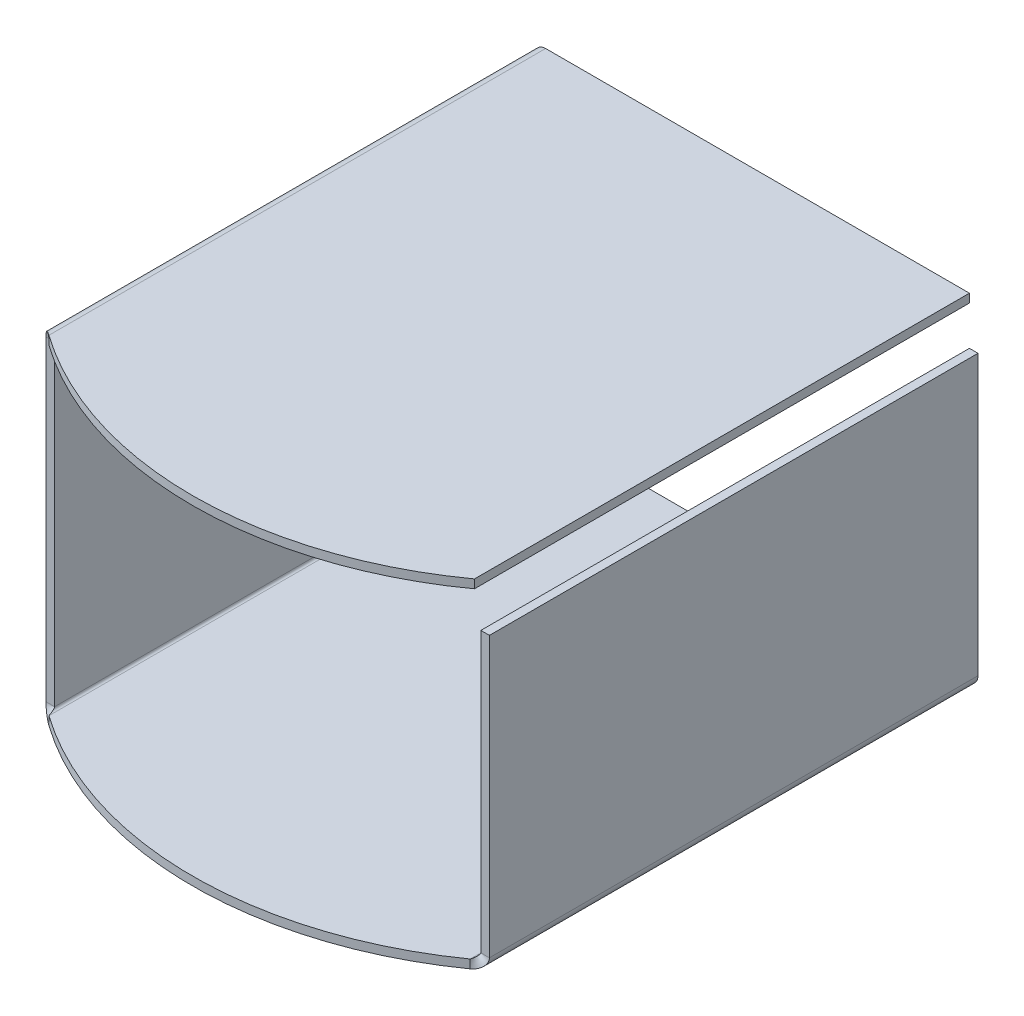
ISO-10303-21;
HEADER;
FILE_DESCRIPTION(('STEP AP214'),'2;1');
FILE_NAME('part.step','',(''),(''),'','','');
FILE_SCHEMA(('AUTOMOTIVE_DESIGN { 1 0 10303 214 1 1 1 1 }'));
ENDSEC;
DATA;
#1=APPLICATION_CONTEXT('core data for automotive mechanical design processes');
#2=APPLICATION_PROTOCOL_DEFINITION('international standard','automotive_design',2000,#1);
#3=PRODUCT_CONTEXT('',#1,'mechanical');
#4=PRODUCT('Part','Part','',(#3));
#5=PRODUCT_RELATED_PRODUCT_CATEGORY('part','',(#4));
#6=PRODUCT_DEFINITION_FORMATION('','',#4);
#7=PRODUCT_DEFINITION_CONTEXT('part definition',#1,'design');
#8=PRODUCT_DEFINITION('design','',#6,#7);
#9=PRODUCT_DEFINITION_SHAPE('','',#8);
#10=(LENGTH_UNIT() NAMED_UNIT(*) SI_UNIT(.MILLI.,.METRE.));
#11=(NAMED_UNIT(*) PLANE_ANGLE_UNIT() SI_UNIT($,.RADIAN.));
#12=(NAMED_UNIT(*) SI_UNIT($,.STERADIAN.) SOLID_ANGLE_UNIT());
#13=UNCERTAINTY_MEASURE_WITH_UNIT(LENGTH_MEASURE(1.E-05),#10,'distance_accuracy_value','');
#14=(GEOMETRIC_REPRESENTATION_CONTEXT(3) GLOBAL_UNCERTAINTY_ASSIGNED_CONTEXT((#13)) GLOBAL_UNIT_ASSIGNED_CONTEXT((#10,
#11,#12)) REPRESENTATION_CONTEXT('',''));
#15=CARTESIAN_POINT('',(0.,0.,0.));
#16=DIRECTION('',(0.,0.,1.));
#17=DIRECTION('',(1.,0.,0.));
#18=AXIS2_PLACEMENT_3D('',#15,#16,#17);
#19=CARTESIAN_POINT('',(60.7785714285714,-40.0957142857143,201.168));
#20=DIRECTION('',(-1.,0.,0.));
#21=DIRECTION('',(0.,0.,1.));
#22=AXIS2_PLACEMENT_3D('',#19,#20,#21);
#23=PLANE('',#22);
#24=DIRECTION('',(0.,-1.,0.));
#25=VECTOR('',#24,1.);
#26=CARTESIAN_POINT('',(60.7785714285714,386.974384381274,144.72450420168));
#27=LINE('',#26,#25);
#28=CARTESIAN_POINT('',(60.7785714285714,43.3614285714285,144.72450420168));
#29=VERTEX_POINT('',#28);
#30=CARTESIAN_POINT('',(60.7785714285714,-39.3591142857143,144.72450420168));
#31=VERTEX_POINT('',#30);
#32=EDGE_CURVE('E160',#29,#31,#27,.T.);
#33=ORIENTED_EDGE('',*,*,#32,.T.);
#34=DIRECTION('',(0.,0.,-1.));
#35=VECTOR('',#34,1.);
#36=CARTESIAN_POINT('',(60.7785714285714,-39.3591142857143,201.168));
#37=LINE('',#36,#35);
#38=CARTESIAN_POINT('',(60.7785714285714,-39.3591142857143,0.));
#39=VERTEX_POINT('',#38);
#40=EDGE_CURVE('E58',#31,#39,#37,.T.);
#41=ORIENTED_EDGE('',*,*,#40,.T.);
#42=DIRECTION('',(0.,1.,0.));
#43=VECTOR('',#42,1.);
#44=CARTESIAN_POINT('',(60.7785714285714,-40.0957142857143,0.));
#45=LINE('',#44,#43);
#46=CARTESIAN_POINT('',(60.7785714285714,43.3614285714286,0.));
#47=VERTEX_POINT('',#46);
#48=EDGE_CURVE('E168',#39,#47,#45,.T.);
#49=ORIENTED_EDGE('',*,*,#48,.T.);
#50=DIRECTION('',(0.,0.,-1.));
#51=VECTOR('',#50,1.);
#52=CARTESIAN_POINT('',(60.7785714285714,43.3614285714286,201.168));
#53=LINE('',#52,#51);
#54=EDGE_CURVE('E186',#29,#47,#53,.T.);
#55=ORIENTED_EDGE('',*,*,#54,.F.);
#56=EDGE_LOOP('',(#33,#41,#49,#55));
#57=FACE_BOUND('',#56,.T.);
#58=ADVANCED_FACE('F35',(#57),#23,.F.);
#59=CARTESIAN_POINT('',(58.2385714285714,43.3614285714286,201.168));
#60=DIRECTION('',(0.,1.,0.));
#61=DIRECTION('',(0.,0.,1.));
#62=AXIS2_PLACEMENT_3D('',#59,#60,#61);
#63=PLANE('',#62);
#64=DIRECTION('',(0.,0.,-1.));
#65=VECTOR('',#64,1.);
#66=CARTESIAN_POINT('',(58.2385714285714,43.3614285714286,201.168));
#67=LINE('',#66,#65);
#68=CARTESIAN_POINT('',(58.2385714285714,43.3614285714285,144.72450420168));
#69=VERTEX_POINT('',#68);
#70=CARTESIAN_POINT('',(58.2385714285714,43.3614285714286,0.));
#71=VERTEX_POINT('',#70);
#72=EDGE_CURVE('E184',#69,#71,#67,.T.);
#73=ORIENTED_EDGE('',*,*,#72,.F.);
#74=DIRECTION('',(1.,0.,0.));
#75=VECTOR('',#74,1.);
#76=CARTESIAN_POINT('',(60.7785714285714,43.3614285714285,144.72450420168));
#77=LINE('',#76,#75);
#78=EDGE_CURVE('E156',#29,#69,#77,.F.);
#79=ORIENTED_EDGE('',*,*,#78,.F.);
#80=ORIENTED_EDGE('',*,*,#54,.T.);
#81=DIRECTION('',(1.,0.,0.));
#82=VECTOR('',#81,1.);
#83=CARTESIAN_POINT('',(58.2385714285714,43.3614285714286,0.));
#84=LINE('',#83,#82);
#85=EDGE_CURVE('E300',#71,#47,#84,.T.);
#86=ORIENTED_EDGE('',*,*,#85,.F.);
#87=EDGE_LOOP('',(#73,#79,#80,#86));
#88=FACE_BOUND('',#87,.T.);
#89=ADVANCED_FACE('F424',(#88),#63,.T.);
#90=CARTESIAN_POINT('',(58.2385714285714,-40.0957142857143,201.168));
#91=DIRECTION('',(-1.,0.,0.));
#92=DIRECTION('',(0.,0.,1.));
#93=AXIS2_PLACEMENT_3D('',#90,#91,#92);
#94=PLANE('',#93);
#95=DIRECTION('',(0.,0.,-1.));
#96=VECTOR('',#95,1.);
#97=CARTESIAN_POINT('',(58.2385714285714,-39.3591142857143,201.168));
#98=LINE('',#97,#96);
#99=CARTESIAN_POINT('',(58.2385714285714,-39.3591142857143,144.72450420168));
#100=VERTEX_POINT('',#99);
#101=CARTESIAN_POINT('',(58.2385714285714,-39.3591142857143,0.));
#102=VERTEX_POINT('',#101);
#103=EDGE_CURVE('E174',#100,#102,#98,.T.);
#104=ORIENTED_EDGE('',*,*,#103,.F.);
#105=DIRECTION('',(0.,1.,0.));
#106=VECTOR('',#105,1.);
#107=CARTESIAN_POINT('',(58.2385714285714,-40.0957142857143,144.72450420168));
#108=LINE('',#107,#106);
#109=EDGE_CURVE('E150',#69,#100,#108,.F.);
#110=ORIENTED_EDGE('',*,*,#109,.F.);
#111=ORIENTED_EDGE('',*,*,#72,.T.);
#112=DIRECTION('',(0.,1.,0.));
#113=VECTOR('',#112,1.);
#114=CARTESIAN_POINT('',(58.2385714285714,-40.0957142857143,0.));
#115=LINE('',#114,#113);
#116=EDGE_CURVE('E182',#102,#71,#115,.T.);
#117=ORIENTED_EDGE('',*,*,#116,.F.);
#118=EDGE_LOOP('',(#104,#110,#111,#117));
#119=FACE_BOUND('',#118,.T.);
#120=ADVANCED_FACE('F180',(#119),#94,.T.);
#121=CARTESIAN_POINT('',(57.5019714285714,-39.3591142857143,201.168));
#122=DIRECTION('',(0.,0.,-1.));
#123=DIRECTION('',(-1.,0.,0.));
#124=AXIS2_PLACEMENT_3D('',#121,#122,#123);
#125=CYLINDRICAL_SURFACE('',#124,0.7366);
#126=DIRECTION('',(0.,0.,-1.));
#127=VECTOR('',#126,1.);
#128=CARTESIAN_POINT('',(57.5019714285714,-40.0957142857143,201.168));
#129=LINE('',#128,#127);
#130=CARTESIAN_POINT('',(57.5019714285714,-40.0957142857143,147.139308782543));
#131=VERTEX_POINT('',#130);
#132=CARTESIAN_POINT('',(57.5019714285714,-40.0957142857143,0.));
#133=VERTEX_POINT('',#132);
#134=EDGE_CURVE('E176',#131,#133,#129,.T.);
#135=ORIENTED_EDGE('',*,*,#134,.F.);
#136=CARTESIAN_POINT('',(58.2385714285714,-39.3591142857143,144.72450420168));
#137=CARTESIAN_POINT('',(58.2385831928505,-39.3723393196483,144.724460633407));
#138=CARTESIAN_POINT('',(58.2382158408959,-39.3855106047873,144.725702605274));
#139=CARTESIAN_POINT('',(58.23683312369,-39.4112369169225,144.730396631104));
#140=CARTESIAN_POINT('',(58.2358268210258,-39.4237979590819,144.733817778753));
#141=CARTESIAN_POINT('',(58.2329203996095,-39.4515257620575,144.743721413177));
#142=CARTESIAN_POINT('',(58.2308507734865,-39.4664615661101,144.750786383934));
#143=CARTESIAN_POINT('',(58.2260663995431,-39.4950443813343,144.767097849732));
#144=CARTESIAN_POINT('',(58.2233478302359,-39.5086830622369,144.776357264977));
#145=CARTESIAN_POINT('',(58.2152393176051,-39.54453779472,144.803983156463));
#146=CARTESIAN_POINT('',(58.2093873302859,-39.5654119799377,144.823929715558));
#147=CARTESIAN_POINT('',(58.196920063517,-39.6041390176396,144.866290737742));
#148=CARTESIAN_POINT('',(58.1903030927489,-39.6219849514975,144.88871066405));
#149=CARTESIAN_POINT('',(58.1731736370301,-39.6637572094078,144.946729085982));
#150=CARTESIAN_POINT('',(58.1623762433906,-39.6862251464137,144.983282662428));
#151=CARTESIAN_POINT('',(58.1401990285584,-39.7276125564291,145.05820667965));
#152=CARTESIAN_POINT('',(58.1288179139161,-39.746523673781,145.096581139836));
#153=CARTESIAN_POINT('',(58.105630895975,-39.7817501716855,145.174597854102));
#154=CARTESIAN_POINT('',(58.0938232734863,-39.7980531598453,145.214245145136));
#155=CARTESIAN_POINT('',(58.0699622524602,-39.8285163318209,145.294218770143));
#156=CARTESIAN_POINT('',(58.0579091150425,-39.8426786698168,145.334544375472));
#157=CARTESIAN_POINT('',(58.024692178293,-39.8790404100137,145.445475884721));
#158=CARTESIAN_POINT('',(58.0033328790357,-39.8995119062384,145.516588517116));
#159=CARTESIAN_POINT('',(57.9601818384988,-39.9365449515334,145.659720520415));
#160=CARTESIAN_POINT('',(57.9383898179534,-39.9531038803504,145.731740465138));
#161=CARTESIAN_POINT('',(57.8945564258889,-39.9829389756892,145.876114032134));
#162=CARTESIAN_POINT('',(57.8725160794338,-39.9962255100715,145.948465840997));
#163=CARTESIAN_POINT('',(57.8281596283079,-40.0200329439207,146.093540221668));
#164=CARTESIAN_POINT('',(57.8058435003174,-40.0305536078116,146.166262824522));
#165=CARTESIAN_POINT('',(57.7603831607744,-40.0493487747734,146.313860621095));
#166=CARTESIAN_POINT('',(57.7372325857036,-40.0575570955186,146.388742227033));
#167=CARTESIAN_POINT('',(57.6907065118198,-40.0715383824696,146.538669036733));
#168=CARTESIAN_POINT('',(57.6673309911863,-40.0773111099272,146.613714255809));
#169=CARTESIAN_POINT('',(57.6203967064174,-40.0865261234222,146.763857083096));
#170=CARTESIAN_POINT('',(57.5968380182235,-40.0899693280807,146.838954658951));
#171=CARTESIAN_POINT('',(57.5495397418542,-40.094557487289,146.989147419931));
#172=CARTESIAN_POINT('',(57.525800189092,-40.0957028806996,147.064242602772));
#173=CARTESIAN_POINT('',(57.5019714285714,-40.0957142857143,147.139308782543));
#174=B_SPLINE_CURVE_WITH_KNOTS('',3,(#136,#137,#138,#139,#140,#141,#142,#143,#144,#145,#146,
#147,#148,#149,#150,#151,#152,#153,#154,#155,#156,#157,#158,#159,#160,#161,#162,#163,#164,#165,
#166,#167,#168,#169,#170,#171,#172,#173),.UNSPECIFIED.,.F.,.F.,(4,2,2,2,2,2,2,2,2,2,2,2,2,2,2,2,
2,2,4),(0.,0.0395242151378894,0.0784999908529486,0.128172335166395,0.178144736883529,
0.266026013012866,0.354105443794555,0.486501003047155,0.619203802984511,0.752519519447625,
0.88570017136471,1.11660478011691,1.34766359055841,1.57798064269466,1.80831730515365,
2.0446979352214,2.28110173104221,2.51741224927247,2.75367763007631),.UNSPECIFIED.);
#175=EDGE_CURVE('E165',#100,#131,#174,.T.);
#176=ORIENTED_EDGE('',*,*,#175,.F.);
#177=ORIENTED_EDGE('',*,*,#103,.T.);
#178=CARTESIAN_POINT('',(57.5019714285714,-39.3591142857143,0.));
#179=DIRECTION('',(0.,0.,-1.));
#180=DIRECTION('',(-1.,0.,0.));
#181=AXIS2_PLACEMENT_3D('',#178,#179,#180);
#182=CIRCLE('',#181,0.7366);
#183=EDGE_CURVE('E294',#133,#102,#182,.F.);
#184=ORIENTED_EDGE('',*,*,#183,.F.);
#185=EDGE_LOOP('',(#135,#176,#177,#184));
#186=FACE_BOUND('',#185,.T.);
#187=ADVANCED_FACE('F172',(#186),#125,.F.);
#188=CARTESIAN_POINT('',(-68.0357142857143,-40.0957142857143,201.168));
#189=DIRECTION('',(0.,1.,0.));
#190=DIRECTION('',(0.,0.,1.));
#191=AXIS2_PLACEMENT_3D('',#188,#189,#190);
#192=PLANE('',#191);
#193=DIRECTION('',(0.,0.,-1.));
#194=VECTOR('',#193,1.);
#195=CARTESIAN_POINT('',(-67.2991142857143,-40.0957142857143,201.168));
#196=LINE('',#195,#194);
#197=CARTESIAN_POINT('',(-67.2991142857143,-40.0957142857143,147.139308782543));
#198=VERTEX_POINT('',#197);
#199=CARTESIAN_POINT('',(-67.2991142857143,-40.0957142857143,0.));
#200=VERTEX_POINT('',#199);
#201=EDGE_CURVE('E188',#198,#200,#196,.T.);
#202=ORIENTED_EDGE('',*,*,#201,.F.);
#203=CARTESIAN_POINT('',(-4.89857142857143,-40.0957142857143,59.0388824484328));
#204=DIRECTION('',(0.,1.,0.));
#205=DIRECTION('',(0.,0.,1.));
#206=AXIS2_PLACEMENT_3D('',#203,#204,#205);
#207=CIRCLE('',#206,107.960700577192);
#208=EDGE_CURVE('E309',#131,#198,#207,.F.);
#209=ORIENTED_EDGE('',*,*,#208,.F.);
#210=ORIENTED_EDGE('',*,*,#134,.T.);
#211=DIRECTION('',(1.,0.,0.));
#212=VECTOR('',#211,1.);
#213=CARTESIAN_POINT('',(-68.0357142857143,-40.0957142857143,0.));
#214=LINE('',#213,#212);
#215=EDGE_CURVE('E289',#200,#133,#214,.T.);
#216=ORIENTED_EDGE('',*,*,#215,.F.);
#217=EDGE_LOOP('',(#202,#209,#210,#216));
#218=FACE_BOUND('',#217,.T.);
#219=ADVANCED_FACE('F292',(#218),#192,.T.);
#220=CARTESIAN_POINT('',(-67.2991142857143,-39.3591142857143,201.168));
#221=DIRECTION('',(0.,0.,-1.));
#222=DIRECTION('',(-1.,0.,0.));
#223=AXIS2_PLACEMENT_3D('',#220,#221,#222);
#224=CYLINDRICAL_SURFACE('',#223,0.7366);
#225=DIRECTION('',(0.,0.,-1.));
#226=VECTOR('',#225,1.);
#227=CARTESIAN_POINT('',(-68.0357142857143,-39.3591142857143,201.168));
#228=LINE('',#227,#226);
#229=CARTESIAN_POINT('',(-68.0357142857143,-39.3591142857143,144.72450420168));
#230=VERTEX_POINT('',#229);
#231=CARTESIAN_POINT('',(-68.0357142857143,-39.3591142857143,0.));
#232=VERTEX_POINT('',#231);
#233=EDGE_CURVE('E223',#230,#232,#228,.T.);
#234=ORIENTED_EDGE('',*,*,#233,.F.);
#235=CARTESIAN_POINT('',(-67.2991142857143,-40.0957142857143,147.139308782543));
#236=CARTESIAN_POINT('',(-67.3233538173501,-40.0957019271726,147.062950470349));
#237=CARTESIAN_POINT('',(-67.347500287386,-40.094517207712,146.986561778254));
#238=CARTESIAN_POINT('',(-67.3956363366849,-40.0897672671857,146.833685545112));
#239=CARTESIAN_POINT('',(-67.4196256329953,-40.0861985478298,146.757198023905));
#240=CARTESIAN_POINT('',(-67.4674199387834,-40.0766417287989,146.604264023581));
#241=CARTESIAN_POINT('',(-67.4912248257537,-40.0706521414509,146.527817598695));
#242=CARTESIAN_POINT('',(-67.5390022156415,-40.0560137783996,146.373799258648));
#243=CARTESIAN_POINT('',(-67.5629707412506,-40.0473217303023,146.296230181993));
#244=CARTESIAN_POINT('',(-67.6106232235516,-40.0271048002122,146.141410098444));
#245=CARTESIAN_POINT('',(-67.6343073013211,-40.0155811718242,146.064158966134));
#246=CARTESIAN_POINT('',(-67.6813492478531,-39.9893545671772,145.910127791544));
#247=CARTESIAN_POINT('',(-67.7047072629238,-39.974653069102,145.833347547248));
#248=CARTESIAN_POINT('',(-67.7418790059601,-39.9480406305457,145.710726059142));
#249=CARTESIAN_POINT('',(-67.7558130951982,-39.937326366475,145.664660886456));
#250=CARTESIAN_POINT('',(-67.7835191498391,-39.9143227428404,145.572865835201));
#251=CARTESIAN_POINT('',(-67.7972910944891,-39.9020331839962,145.527135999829));
#252=CARTESIAN_POINT('',(-67.8245812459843,-39.8756630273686,145.436330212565));
#253=CARTESIAN_POINT('',(-67.8381002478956,-39.8615897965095,145.391252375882));
#254=CARTESIAN_POINT('',(-67.8648689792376,-39.8312496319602,145.301767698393));
#255=CARTESIAN_POINT('',(-67.8781188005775,-39.8149834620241,145.257360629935));
#256=CARTESIAN_POINT('',(-67.90117173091,-39.7838347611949,145.179937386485));
#257=CARTESIAN_POINT('',(-67.9110488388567,-39.7695349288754,145.146711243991));
#258=CARTESIAN_POINT('',(-67.9305469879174,-39.738855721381,145.081038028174));
#259=CARTESIAN_POINT('',(-67.940167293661,-39.7224710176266,145.048593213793));
#260=CARTESIAN_POINT('',(-67.9599923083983,-39.6851771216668,144.981640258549));
#261=CARTESIAN_POINT('',(-67.9701515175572,-39.6639729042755,144.947275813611));
#262=CARTESIAN_POINT('',(-67.9846885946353,-39.6287907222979,144.89799703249));
#263=CARTESIAN_POINT('',(-67.9894110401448,-39.6165207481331,144.881970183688));
#264=CARTESIAN_POINT('',(-67.99853222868,-39.590595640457,144.850990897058));
#265=CARTESIAN_POINT('',(-68.0029313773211,-39.5769422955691,144.836037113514));
#266=CARTESIAN_POINT('',(-68.0104681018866,-39.5506979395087,144.810402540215));
#267=CARTESIAN_POINT('',(-68.0136864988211,-39.5383986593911,144.79944994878));
#268=CARTESIAN_POINT('',(-68.0196884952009,-39.5125054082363,144.779020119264));
#269=CARTESIAN_POINT('',(-68.0224721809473,-39.4989116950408,144.769542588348));
#270=CARTESIAN_POINT('',(-68.0270401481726,-39.4724937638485,144.753992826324));
#271=CARTESIAN_POINT('',(-68.0289118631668,-39.459863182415,144.747622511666));
#272=CARTESIAN_POINT('',(-68.0320458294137,-39.4336986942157,144.736961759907));
#273=CARTESIAN_POINT('',(-68.0333102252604,-39.4201681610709,144.732664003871));
#274=CARTESIAN_POINT('',(-68.034695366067,-39.3986131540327,144.727959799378));
#275=CARTESIAN_POINT('',(-68.0350745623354,-39.3907924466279,144.726673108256));
#276=CARTESIAN_POINT('',(-68.0355852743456,-39.3750219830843,144.724940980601));
#277=CARTESIAN_POINT('',(-68.0357158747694,-39.3670718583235,144.724498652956));
#278=CARTESIAN_POINT('',(-68.0357142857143,-39.3591142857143,144.72450420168));
#279=B_SPLINE_CURVE_WITH_KNOTS('',3,(#235,#236,#237,#238,#239,#240,#241,#242,#243,#244,#245,
#246,#247,#248,#249,#250,#251,#252,#253,#254,#255,#256,#257,#258,#259,#260,#261,#262,#263,#264,
#265,#266,#267,#268,#269,#270,#271,#272,#273,#274,#275,#276,#277,#278),.UNSPECIFIED.,.F.,.F.,(4,
2,2,2,2,2,2,2,2,2,2,2,2,2,2,2,2,2,2,2,2,4),(0.,0.240332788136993,0.481019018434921,
0.721853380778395,0.966762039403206,1.211562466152,1.45624926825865,1.60414223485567,
1.75205392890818,1.89937349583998,2.04664188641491,2.15907836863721,2.27180821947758,
2.39643714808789,2.45857312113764,2.52062975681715,2.57088527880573,2.62113081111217,
2.66379107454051,2.70629956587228,2.73005846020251,2.75390466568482),.UNSPECIFIED.);
#280=EDGE_CURVE('E280',#198,#230,#279,.T.);
#281=ORIENTED_EDGE('',*,*,#280,.F.);
#282=ORIENTED_EDGE('',*,*,#201,.T.);
#283=CARTESIAN_POINT('',(-67.2991142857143,-39.3591142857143,0.));
#284=DIRECTION('',(0.,0.,-1.));
#285=DIRECTION('',(-1.,0.,0.));
#286=AXIS2_PLACEMENT_3D('',#283,#284,#285);
#287=CIRCLE('',#286,0.7366);
#288=EDGE_CURVE('E226',#232,#200,#287,.F.);
#289=ORIENTED_EDGE('',*,*,#288,.F.);
#290=EDGE_LOOP('',(#234,#281,#282,#289));
#291=FACE_BOUND('',#290,.T.);
#292=ADVANCED_FACE('F278',(#291),#224,.F.);
#293=CARTESIAN_POINT('',(-68.0357142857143,54.9728571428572,201.168));
#294=DIRECTION('',(1.,0.,0.));
#295=DIRECTION('',(0.,0.,-1.));
#296=AXIS2_PLACEMENT_3D('',#293,#294,#295);
#297=PLANE('',#296);
#298=DIRECTION('',(0.,0.,-1.));
#299=VECTOR('',#298,1.);
#300=CARTESIAN_POINT('',(-68.0357142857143,54.2362571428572,201.168));
#301=LINE('',#300,#299);
#302=CARTESIAN_POINT('',(-68.0357142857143,54.2362571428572,144.72450420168));
#303=VERTEX_POINT('',#302);
#304=CARTESIAN_POINT('',(-68.0357142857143,54.2362571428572,0.));
#305=VERTEX_POINT('',#304);
#306=EDGE_CURVE('E221',#303,#305,#301,.T.);
#307=ORIENTED_EDGE('',*,*,#306,.F.);
#308=DIRECTION('',(0.,1.,0.));
#309=VECTOR('',#308,1.);
#310=CARTESIAN_POINT('',(-68.0357142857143,54.9728571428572,144.72450420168));
#311=LINE('',#310,#309);
#312=EDGE_CURVE('E318',#303,#230,#311,.F.);
#313=ORIENTED_EDGE('',*,*,#312,.T.);
#314=ORIENTED_EDGE('',*,*,#233,.T.);
#315=DIRECTION('',(0.,-1.,0.));
#316=VECTOR('',#315,1.);
#317=CARTESIAN_POINT('',(-68.0357142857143,54.9728571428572,0.));
#318=LINE('',#317,#316);
#319=EDGE_CURVE('E210',#305,#232,#318,.T.);
#320=ORIENTED_EDGE('',*,*,#319,.F.);
#321=EDGE_LOOP('',(#307,#313,#314,#320));
#322=FACE_BOUND('',#321,.T.);
#323=ADVANCED_FACE('F219',(#322),#297,.T.);
#324=CARTESIAN_POINT('',(-67.2991142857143,54.2362571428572,201.168));
#325=DIRECTION('',(0.,0.,-1.));
#326=DIRECTION('',(-1.,0.,0.));
#327=AXIS2_PLACEMENT_3D('',#324,#325,#326);
#328=CYLINDRICAL_SURFACE('',#327,0.7366);
#329=DIRECTION('',(0.,0.,-1.));
#330=VECTOR('',#329,1.);
#331=CARTESIAN_POINT('',(-67.2991142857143,54.9728571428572,201.168));
#332=LINE('',#331,#330);
#333=CARTESIAN_POINT('',(-67.2991142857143,54.9728571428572,147.139308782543));
#334=VERTEX_POINT('',#333);
#335=CARTESIAN_POINT('',(-67.2991142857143,54.9728571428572,0.));
#336=VERTEX_POINT('',#335);
#337=EDGE_CURVE('E271',#334,#336,#332,.T.);
#338=ORIENTED_EDGE('',*,*,#337,.F.);
#339=CARTESIAN_POINT('',(-68.0357142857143,54.2362571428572,144.72450420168));
#340=CARTESIAN_POINT('',(-68.0357260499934,54.2494821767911,144.724460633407));
#341=CARTESIAN_POINT('',(-68.0353586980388,54.2626534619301,144.725702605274));
#342=CARTESIAN_POINT('',(-68.0339759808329,54.2883797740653,144.730396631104));
#343=CARTESIAN_POINT('',(-68.0329696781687,54.3009408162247,144.733817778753));
#344=CARTESIAN_POINT('',(-68.0300632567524,54.3286686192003,144.743721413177));
#345=CARTESIAN_POINT('',(-68.0279936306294,54.3436044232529,144.750786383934));
#346=CARTESIAN_POINT('',(-68.023209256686,54.372187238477,144.767097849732));
#347=CARTESIAN_POINT('',(-68.0204906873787,54.3858259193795,144.776357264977));
#348=CARTESIAN_POINT('',(-68.012382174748,54.4216806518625,144.803983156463));
#349=CARTESIAN_POINT('',(-68.0065301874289,54.4425548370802,144.823929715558));
#350=CARTESIAN_POINT('',(-67.9940629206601,54.481281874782,144.866290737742));
#351=CARTESIAN_POINT('',(-67.987445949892,54.4991278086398,144.888710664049));
#352=CARTESIAN_POINT('',(-67.9703164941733,54.5409000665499,144.946729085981));
#353=CARTESIAN_POINT('',(-67.9595191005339,54.5633680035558,144.983282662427));
#354=CARTESIAN_POINT('',(-67.9373418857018,54.6047554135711,145.058206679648));
#355=CARTESIAN_POINT('',(-67.9259607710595,54.623666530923,145.096581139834));
#356=CARTESIAN_POINT('',(-67.9027737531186,54.6588930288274,145.1745978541));
#357=CARTESIAN_POINT('',(-67.8909661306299,54.6751960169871,145.214245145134));
#358=CARTESIAN_POINT('',(-67.867105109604,54.7056591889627,145.294218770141));
#359=CARTESIAN_POINT('',(-67.8550519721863,54.7198215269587,145.334544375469));
#360=CARTESIAN_POINT('',(-67.8218350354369,54.7561832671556,145.445475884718));
#361=CARTESIAN_POINT('',(-67.8004757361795,54.7766547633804,145.516588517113));
#362=CARTESIAN_POINT('',(-67.7573246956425,54.8136878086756,145.659720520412));
#363=CARTESIAN_POINT('',(-67.735532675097,54.8302467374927,145.731740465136));
#364=CARTESIAN_POINT('',(-67.6916992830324,54.8600818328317,145.876114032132));
#365=CARTESIAN_POINT('',(-67.6696589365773,54.873368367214,145.948465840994));
#366=CARTESIAN_POINT('',(-67.6253024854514,54.8971758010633,146.093540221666));
#367=CARTESIAN_POINT('',(-67.6029863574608,54.9076964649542,146.16626282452));
#368=CARTESIAN_POINT('',(-67.5575260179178,54.9264916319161,146.313860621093));
#369=CARTESIAN_POINT('',(-67.5343754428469,54.9346999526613,146.388742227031));
#370=CARTESIAN_POINT('',(-67.4878493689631,54.9486812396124,146.538669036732));
#371=CARTESIAN_POINT('',(-67.4644738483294,54.95445396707,146.613714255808));
#372=CARTESIAN_POINT('',(-67.4175395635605,54.9636689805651,146.763857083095));
#373=CARTESIAN_POINT('',(-67.3939808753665,54.9671121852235,146.838954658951));
#374=CARTESIAN_POINT('',(-67.3466825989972,54.9717003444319,146.989147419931));
#375=CARTESIAN_POINT('',(-67.3229430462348,54.9728457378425,147.064242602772));
#376=CARTESIAN_POINT('',(-67.2991142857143,54.9728571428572,147.139308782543));
#377=B_SPLINE_CURVE_WITH_KNOTS('',3,(#339,#340,#341,#342,#343,#344,#345,#346,#347,#348,#349,
#350,#351,#352,#353,#354,#355,#356,#357,#358,#359,#360,#361,#362,#363,#364,#365,#366,#367,#368,
#369,#370,#371,#372,#373,#374,#375,#376),.UNSPECIFIED.,.F.,.F.,(4,2,2,2,2,2,2,2,2,2,2,2,2,2,2,2,
2,2,4),(0.,0.0395242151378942,0.0784999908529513,0.128172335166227,0.17814473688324,
0.266026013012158,0.354105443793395,0.486501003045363,0.619203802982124,0.75251951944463,
0.88570017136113,1.11660478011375,1.3476635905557,1.57798064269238,1.8083173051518,
2.04469793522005,2.28110173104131,2.51741224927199,2.75367763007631),.UNSPECIFIED.);
#378=EDGE_CURVE('E335',#303,#334,#377,.T.);
#379=ORIENTED_EDGE('',*,*,#378,.F.);
#380=ORIENTED_EDGE('',*,*,#306,.T.);
#381=CARTESIAN_POINT('',(-67.2991142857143,54.2362571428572,0.));
#382=DIRECTION('',(0.,0.,-1.));
#383=DIRECTION('',(-1.,0.,0.));
#384=AXIS2_PLACEMENT_3D('',#381,#382,#383);
#385=CIRCLE('',#384,0.7366);
#386=EDGE_CURVE('E225',#336,#305,#385,.F.);
#387=ORIENTED_EDGE('',*,*,#386,.F.);
#388=EDGE_LOOP('',(#338,#379,#380,#387));
#389=FACE_BOUND('',#388,.T.);
#390=ADVANCED_FACE('F412',(#389),#328,.F.);
#391=CARTESIAN_POINT('',(58.2385714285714,54.9728571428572,201.168));
#392=DIRECTION('',(0.,-1.,0.));
#393=DIRECTION('',(0.,0.,-1.));
#394=AXIS2_PLACEMENT_3D('',#391,#392,#393);
#395=PLANE('',#394);
#396=DIRECTION('',(0.,0.,-1.));
#397=VECTOR('',#396,1.);
#398=CARTESIAN_POINT('',(58.2385714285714,54.9728571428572,201.168));
#399=LINE('',#398,#397);
#400=CARTESIAN_POINT('',(58.2385714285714,54.9728571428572,146.612931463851));
#401=VERTEX_POINT('',#400);
#402=CARTESIAN_POINT('',(58.2385714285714,54.9728571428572,0.));
#403=VERTEX_POINT('',#402);
#404=EDGE_CURVE('E269',#401,#403,#399,.T.);
#405=ORIENTED_EDGE('',*,*,#404,.F.);
#406=CARTESIAN_POINT('',(-4.89857142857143,54.9728571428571,59.0388824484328));
#407=DIRECTION('',(0.,-1.,0.));
#408=DIRECTION('',(0.,0.,-1.));
#409=AXIS2_PLACEMENT_3D('',#406,#407,#408);
#410=CIRCLE('',#409,107.960700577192);
#411=EDGE_CURVE('E329',#334,#401,#410,.F.);
#412=ORIENTED_EDGE('',*,*,#411,.F.);
#413=ORIENTED_EDGE('',*,*,#337,.T.);
#414=DIRECTION('',(-1.,0.,0.));
#415=VECTOR('',#414,1.);
#416=CARTESIAN_POINT('',(58.2385714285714,54.9728571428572,0.));
#417=LINE('',#416,#415);
#418=EDGE_CURVE('E233',#403,#336,#417,.T.);
#419=ORIENTED_EDGE('',*,*,#418,.F.);
#420=EDGE_LOOP('',(#405,#412,#413,#419));
#421=FACE_BOUND('',#420,.T.);
#422=ADVANCED_FACE('F410',(#421),#395,.T.);
#423=CARTESIAN_POINT('',(58.2385714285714,57.5128571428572,201.168));
#424=DIRECTION('',(1.,0.,0.));
#425=DIRECTION('',(0.,0.,-1.));
#426=AXIS2_PLACEMENT_3D('',#423,#424,#425);
#427=PLANE('',#426);
#428=DIRECTION('',(0.,0.,-1.));
#429=VECTOR('',#428,1.);
#430=CARTESIAN_POINT('',(58.2385714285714,57.5128571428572,201.168));
#431=LINE('',#430,#429);
#432=CARTESIAN_POINT('',(58.2385714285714,57.5128571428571,146.612931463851));
#433=VERTEX_POINT('',#432);
#434=CARTESIAN_POINT('',(58.2385714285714,57.5128571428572,0.));
#435=VERTEX_POINT('',#434);
#436=EDGE_CURVE('E267',#433,#435,#431,.T.);
#437=ORIENTED_EDGE('',*,*,#436,.F.);
#438=DIRECTION('',(0.,1.,0.));
#439=VECTOR('',#438,1.);
#440=CARTESIAN_POINT('',(58.2385714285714,57.5128571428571,146.612931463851));
#441=LINE('',#440,#439);
#442=EDGE_CURVE('E324',#433,#401,#441,.F.);
#443=ORIENTED_EDGE('',*,*,#442,.T.);
#444=ORIENTED_EDGE('',*,*,#404,.T.);
#445=DIRECTION('',(0.,-1.,0.));
#446=VECTOR('',#445,1.);
#447=CARTESIAN_POINT('',(58.2385714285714,57.5128571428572,0.));
#448=LINE('',#447,#446);
#449=EDGE_CURVE('E235',#435,#403,#448,.T.);
#450=ORIENTED_EDGE('',*,*,#449,.F.);
#451=EDGE_LOOP('',(#437,#443,#444,#450));
#452=FACE_BOUND('',#451,.T.);
#453=ADVANCED_FACE('F406',(#452),#427,.T.);
#454=CARTESIAN_POINT('',(58.2385714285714,57.5128571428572,201.168));
#455=DIRECTION('',(0.,-1.,0.));
#456=DIRECTION('',(0.,0.,-1.));
#457=AXIS2_PLACEMENT_3D('',#454,#455,#456);
#458=PLANE('',#457);
#459=CARTESIAN_POINT('',(-4.89857142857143,57.5128571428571,59.0388824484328));
#460=DIRECTION('',(0.,-1.,0.));
#461=DIRECTION('',(0.,0.,-1.));
#462=AXIS2_PLACEMENT_3D('',#459,#460,#461);
#463=CIRCLE('',#462,107.960700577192);
#464=CARTESIAN_POINT('',(-67.2991142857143,57.5128571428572,147.139308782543));
#465=VERTEX_POINT('',#464);
#466=EDGE_CURVE('E332',#465,#433,#463,.F.);
#467=ORIENTED_EDGE('',*,*,#466,.T.);
#468=ORIENTED_EDGE('',*,*,#436,.T.);
#469=DIRECTION('',(1.,0.,0.));
#470=VECTOR('',#469,1.);
#471=CARTESIAN_POINT('',(58.2385714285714,57.5128571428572,0.));
#472=LINE('',#471,#470);
#473=CARTESIAN_POINT('',(-67.2991142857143,57.5128571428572,0.));
#474=VERTEX_POINT('',#473);
#475=EDGE_CURVE('E241',#435,#474,#472,.F.);
#476=ORIENTED_EDGE('',*,*,#475,.T.);
#477=DIRECTION('',(0.,0.,-1.));
#478=VECTOR('',#477,1.);
#479=CARTESIAN_POINT('',(-67.2991142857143,57.5128571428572,201.168));
#480=LINE('',#479,#478);
#481=EDGE_CURVE('E265',#465,#474,#480,.T.);
#482=ORIENTED_EDGE('',*,*,#481,.F.);
#483=EDGE_LOOP('',(#467,#468,#476,#482));
#484=FACE_BOUND('',#483,.T.);
#485=ADVANCED_FACE('F402',(#484),#458,.F.);
#486=CARTESIAN_POINT('',(-67.2991142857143,54.2362571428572,201.168));
#487=DIRECTION('',(0.,0.,-1.));
#488=DIRECTION('',(-1.,0.,0.));
#489=AXIS2_PLACEMENT_3D('',#486,#487,#488);
#490=CYLINDRICAL_SURFACE('',#489,3.2766);
#491=CARTESIAN_POINT('',(-70.5757142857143,54.2362571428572,144.72450420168));
#492=CARTESIAN_POINT('',(-70.5757150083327,54.2796039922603,144.724503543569));
#493=CARTESIAN_POINT('',(-70.5748539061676,54.3229441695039,144.725156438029));
#494=CARTESIAN_POINT('',(-70.5714170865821,54.4095137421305,144.727773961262));
#495=CARTESIAN_POINT('',(-70.5688414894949,54.4527431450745,144.729738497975));
#496=CARTESIAN_POINT('',(-70.5585630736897,54.5820432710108,144.737601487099));
#497=CARTESIAN_POINT('',(-70.5483085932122,54.6678116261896,144.745469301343));
#498=CARTESIAN_POINT('',(-70.5213059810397,54.836978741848,144.766161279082));
#499=CARTESIAN_POINT('',(-70.50461070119,54.920391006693,144.778945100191));
#500=CARTESIAN_POINT('',(-70.4650560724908,55.084835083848,144.809242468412));
#501=CARTESIAN_POINT('',(-70.4421965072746,55.1658668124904,144.826756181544));
#502=CARTESIAN_POINT('',(-70.3715414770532,55.384066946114,144.880722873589));
#503=CARTESIAN_POINT('',(-70.3178239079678,55.5183135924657,144.921590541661));
#504=CARTESIAN_POINT('',(-70.2259406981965,55.7110120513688,144.991486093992));
#505=CARTESIAN_POINT('',(-70.1933920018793,55.7738554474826,145.016244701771));
#506=CARTESIAN_POINT('',(-70.1248078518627,55.8965266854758,145.068308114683));
#507=CARTESIAN_POINT('',(-70.0887720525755,55.9563542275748,145.095613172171));
#508=CARTESIAN_POINT('',(-69.9654113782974,56.1472501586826,145.18894607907));
#509=CARTESIAN_POINT('',(-69.8713731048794,56.271694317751,145.259881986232));
#510=CARTESIAN_POINT('',(-69.6702196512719,56.5028637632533,145.411083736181));
#511=CARTESIAN_POINT('',(-69.5631001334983,56.6095831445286,145.491352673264));
#512=CARTESIAN_POINT('',(-69.3166605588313,56.8241548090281,145.675201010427));
#513=CARTESIAN_POINT('',(-69.1751295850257,56.9281913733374,145.780277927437));
#514=CARTESIAN_POINT('',(-68.8811980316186,57.110828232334,145.997321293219));
#515=CARTESIAN_POINT('',(-68.7287810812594,57.1893891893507,146.109298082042));
#516=CARTESIAN_POINT('',(-68.3688064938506,57.3411978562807,146.372172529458));
#517=CARTESIAN_POINT('',(-68.1585430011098,57.4056109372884,146.524576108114));
#518=CARTESIAN_POINT('',(-67.8386392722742,57.4699634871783,146.75472437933));
#519=CARTESIAN_POINT('',(-67.7313388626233,57.4860364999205,146.8316369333));
#520=CARTESIAN_POINT('',(-67.5158016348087,57.5074703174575,146.985526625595));
#521=CARTESIAN_POINT('',(-67.4075653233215,57.5128365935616,147.062503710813));
#522=CARTESIAN_POINT('',(-67.2991142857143,57.5128571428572,147.139308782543));
#523=B_SPLINE_CURVE_WITH_KNOTS('',3,(#491,#492,#493,#494,#495,#496,#497,#498,#499,#500,#501,
#502,#503,#504,#505,#506,#507,#508,#509,#510,#511,#512,#513,#514,#515,#516,#517,#518,#519,#520,
#521,#522),.UNSPECIFIED.,.F.,.F.,(4,2,2,2,2,2,2,2,2,2,2,2,2,2,2,4),(0.,0.130013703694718,
0.260018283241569,0.519771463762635,0.777437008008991,1.03511159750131,1.48382797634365,
1.70861568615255,1.93342569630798,2.44541806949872,2.9575806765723,3.56934429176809,
4.18204810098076,4.98054134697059,5.37916562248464,5.77758614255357),.UNSPECIFIED.);
#524=CARTESIAN_POINT('',(-70.5757142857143,54.2362571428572,144.72450420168));
#525=VERTEX_POINT('',#524);
#526=EDGE_CURVE('E337',#525,#465,#523,.T.);
#527=ORIENTED_EDGE('',*,*,#526,.T.);
#528=ORIENTED_EDGE('',*,*,#481,.T.);
#529=CARTESIAN_POINT('',(-67.2991142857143,54.2362571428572,0.));
#530=DIRECTION('',(0.,0.,1.));
#531=DIRECTION('',(1.,0.,0.));
#532=AXIS2_PLACEMENT_3D('',#529,#530,#531);
#533=CIRCLE('',#532,3.2766);
#534=CARTESIAN_POINT('',(-70.5757142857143,54.2362571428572,0.));
#535=VERTEX_POINT('',#534);
#536=EDGE_CURVE('E244',#474,#535,#533,.T.);
#537=ORIENTED_EDGE('',*,*,#536,.T.);
#538=DIRECTION('',(0.,0.,-1.));
#539=VECTOR('',#538,1.);
#540=CARTESIAN_POINT('',(-70.5757142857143,54.2362571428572,201.168));
#541=LINE('',#540,#539);
#542=EDGE_CURVE('E263',#525,#535,#541,.T.);
#543=ORIENTED_EDGE('',*,*,#542,.F.);
#544=EDGE_LOOP('',(#527,#528,#537,#543));
#545=FACE_BOUND('',#544,.T.);
#546=ADVANCED_FACE('F394',(#545),#490,.T.);
#547=CARTESIAN_POINT('',(-70.5757142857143,54.9728571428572,201.168));
#548=DIRECTION('',(1.,0.,0.));
#549=DIRECTION('',(0.,0.,-1.));
#550=AXIS2_PLACEMENT_3D('',#547,#548,#549);
#551=PLANE('',#550);
#552=DIRECTION('',(0.,-1.,0.));
#553=VECTOR('',#552,1.);
#554=CARTESIAN_POINT('',(-70.5757142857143,386.974384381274,144.72450420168));
#555=LINE('',#554,#553);
#556=CARTESIAN_POINT('',(-70.5757142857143,-39.3591142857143,144.72450420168));
#557=VERTEX_POINT('',#556);
#558=EDGE_CURVE('E321',#525,#557,#555,.T.);
#559=ORIENTED_EDGE('',*,*,#558,.F.);
#560=ORIENTED_EDGE('',*,*,#542,.T.);
#561=DIRECTION('',(0.,1.,0.));
#562=VECTOR('',#561,1.);
#563=CARTESIAN_POINT('',(-70.5757142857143,54.9728571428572,0.));
#564=LINE('',#563,#562);
#565=CARTESIAN_POINT('',(-70.5757142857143,-39.3591142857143,0.));
#566=VERTEX_POINT('',#565);
#567=EDGE_CURVE('E212',#535,#566,#564,.F.);
#568=ORIENTED_EDGE('',*,*,#567,.T.);
#569=DIRECTION('',(0.,0.,-1.));
#570=VECTOR('',#569,1.);
#571=CARTESIAN_POINT('',(-70.5757142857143,-39.3591142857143,201.168));
#572=LINE('',#571,#570);
#573=EDGE_CURVE('E261',#557,#566,#572,.T.);
#574=ORIENTED_EDGE('',*,*,#573,.F.);
#575=EDGE_LOOP('',(#559,#560,#568,#574));
#576=FACE_BOUND('',#575,.T.);
#577=ADVANCED_FACE('F392',(#576),#551,.F.);
#578=CARTESIAN_POINT('',(-67.2991142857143,-39.3591142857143,201.168));
#579=DIRECTION('',(0.,0.,-1.));
#580=DIRECTION('',(-1.,0.,0.));
#581=AXIS2_PLACEMENT_3D('',#578,#579,#580);
#582=CYLINDRICAL_SURFACE('',#581,3.2766);
#583=CARTESIAN_POINT('',(-67.2991142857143,-42.6357142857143,147.139308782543));
#584=CARTESIAN_POINT('',(-67.4341001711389,-42.6356952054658,147.043719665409));
#585=CARTESIAN_POINT('',(-67.5688266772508,-42.627373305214,146.947799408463));
#586=CARTESIAN_POINT('',(-67.8128339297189,-42.597100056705,146.7732427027));
#587=CARTESIAN_POINT('',(-67.9224068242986,-42.5778150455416,146.694545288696));
#588=CARTESIAN_POINT('',(-68.1395796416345,-42.5280455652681,146.538002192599));
#589=CARTESIAN_POINT('',(-68.2471799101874,-42.497563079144,146.460156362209));
#590=CARTESIAN_POINT('',(-68.4596590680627,-42.4253566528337,146.305825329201));
#591=CARTESIAN_POINT('',(-68.5645364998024,-42.3836268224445,146.229340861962));
#592=CARTESIAN_POINT('',(-68.7707640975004,-42.2888327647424,146.078380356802));
#593=CARTESIAN_POINT('',(-68.8721095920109,-42.2357541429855,146.003907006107));
#594=CARTESIAN_POINT('',(-69.1300183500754,-42.0827188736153,145.813715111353));
#595=CARTESIAN_POINT('',(-69.2830224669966,-41.9737960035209,145.70020875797));
#596=CARTESIAN_POINT('',(-69.5722937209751,-41.7265642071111,145.484565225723));
#597=CARTESIAN_POINT('',(-69.7085902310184,-41.5883080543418,145.382408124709));
#598=CARTESIAN_POINT('',(-69.8843313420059,-41.3738640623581,145.250082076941));
#599=CARTESIAN_POINT('',(-69.9333079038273,-41.3094443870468,145.213126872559));
#600=CARTESIAN_POINT('',(-70.0270334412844,-41.1760347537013,145.142283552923));
#601=CARTESIAN_POINT('',(-70.0717847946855,-41.1070474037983,145.108393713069));
#602=CARTESIAN_POINT('',(-70.156611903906,-40.9646326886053,145.044098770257));
#603=CARTESIAN_POINT('',(-70.1966844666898,-40.8912023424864,145.013696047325));
#604=CARTESIAN_POINT('',(-70.2715865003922,-40.7402774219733,144.956775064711));
#605=CARTESIAN_POINT('',(-70.3064167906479,-40.6627834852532,144.930256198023));
#606=CARTESIAN_POINT('',(-70.3706328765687,-40.5033758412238,144.881299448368));
#607=CARTESIAN_POINT('',(-70.3999630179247,-40.4214267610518,144.858903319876));
#608=CARTESIAN_POINT('',(-70.4522373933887,-40.2544193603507,144.818953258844));
#609=CARTESIAN_POINT('',(-70.4751856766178,-40.1693630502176,144.80139625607));
#610=CARTESIAN_POINT('',(-70.5142342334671,-39.9970034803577,144.771515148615));
#611=CARTESIAN_POINT('',(-70.5303501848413,-39.9097058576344,144.759179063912));
#612=CARTESIAN_POINT('',(-70.555463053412,-39.7335499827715,144.739967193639));
#613=CARTESIAN_POINT('',(-70.5644661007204,-39.6446931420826,144.733086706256));
#614=CARTESIAN_POINT('',(-70.5717859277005,-39.5228333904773,144.727498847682));
#615=CARTESIAN_POINT('',(-70.5732594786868,-39.4900958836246,144.726374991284));
#616=CARTESIAN_POINT('',(-70.5752229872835,-39.4246121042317,144.72487815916));
#617=CARTESIAN_POINT('',(-70.5757140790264,-39.3918658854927,144.724504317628));
#618=CARTESIAN_POINT('',(-70.5757142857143,-39.3591142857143,144.72450420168));
#619=B_SPLINE_CURVE_WITH_KNOTS('',3,(#583,#584,#585,#586,#587,#588,#589,#590,#591,#592,#593,
#594,#595,#596,#597,#598,#599,#600,#601,#602,#603,#604,#605,#606,#607,#608,#609,#610,#611,#612,
#613,#614,#615,#616,#617,#618),.UNSPECIFIED.,.F.,.F.,(4,2,2,2,2,2,2,2,2,2,2,2,2,2,2,2,2,4),(0.,
0.495950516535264,0.904321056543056,1.31261931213,1.72113180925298,2.13016555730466,
2.78587917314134,3.44042294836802,3.70709838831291,3.97362284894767,4.24032814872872,
4.5069917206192,4.77622299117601,5.04528304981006,5.3137223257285,5.58192999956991,
5.68028183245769,5.77852006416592),.UNSPECIFIED.);
#620=CARTESIAN_POINT('',(-67.2991142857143,-42.6357142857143,147.139308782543));
#621=VERTEX_POINT('',#620);
#622=EDGE_CURVE('E177',#621,#557,#619,.T.);
#623=ORIENTED_EDGE('',*,*,#622,.T.);
#624=ORIENTED_EDGE('',*,*,#573,.T.);
#625=CARTESIAN_POINT('',(-67.2991142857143,-39.3591142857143,0.));
#626=DIRECTION('',(0.,0.,1.));
#627=DIRECTION('',(1.,0.,0.));
#628=AXIS2_PLACEMENT_3D('',#625,#626,#627);
#629=CIRCLE('',#628,3.2766);
#630=CARTESIAN_POINT('',(-67.2991142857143,-42.6357142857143,0.));
#631=VERTEX_POINT('',#630);
#632=EDGE_CURVE('E247',#566,#631,#629,.T.);
#633=ORIENTED_EDGE('',*,*,#632,.T.);
#634=DIRECTION('',(0.,0.,-1.));
#635=VECTOR('',#634,1.);
#636=CARTESIAN_POINT('',(-67.2991142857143,-42.6357142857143,201.168));
#637=LINE('',#636,#635);
#638=EDGE_CURVE('E259',#621,#631,#637,.T.);
#639=ORIENTED_EDGE('',*,*,#638,.F.);
#640=EDGE_LOOP('',(#623,#624,#633,#639));
#641=FACE_BOUND('',#640,.T.);
#642=ADVANCED_FACE('F457',(#641),#582,.T.);
#643=CARTESIAN_POINT('',(-68.0357142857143,-42.6357142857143,201.168));
#644=DIRECTION('',(0.,1.,0.));
#645=DIRECTION('',(0.,0.,1.));
#646=AXIS2_PLACEMENT_3D('',#643,#644,#645);
#647=PLANE('',#646);
#648=CARTESIAN_POINT('',(-4.89857142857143,-42.6357142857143,59.0388824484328));
#649=DIRECTION('',(0.,1.,0.));
#650=DIRECTION('',(0.,0.,1.));
#651=AXIS2_PLACEMENT_3D('',#648,#649,#650);
#652=CIRCLE('',#651,107.960700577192);
#653=CARTESIAN_POINT('',(57.5019714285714,-42.6357142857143,147.139308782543));
#654=VERTEX_POINT('',#653);
#655=EDGE_CURVE('E50',#654,#621,#652,.F.);
#656=ORIENTED_EDGE('',*,*,#655,.T.);
#657=ORIENTED_EDGE('',*,*,#638,.T.);
#658=DIRECTION('',(1.,0.,0.));
#659=VECTOR('',#658,1.);
#660=CARTESIAN_POINT('',(-68.0357142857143,-42.6357142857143,0.));
#661=LINE('',#660,#659);
#662=CARTESIAN_POINT('',(57.5019714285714,-42.6357142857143,0.));
#663=VERTEX_POINT('',#662);
#664=EDGE_CURVE('E250',#631,#663,#661,.T.);
#665=ORIENTED_EDGE('',*,*,#664,.T.);
#666=DIRECTION('',(0.,0.,-1.));
#667=VECTOR('',#666,1.);
#668=CARTESIAN_POINT('',(57.5019714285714,-42.6357142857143,201.168));
#669=LINE('',#668,#667);
#670=EDGE_CURVE('E257',#654,#663,#669,.T.);
#671=ORIENTED_EDGE('',*,*,#670,.F.);
#672=EDGE_LOOP('',(#656,#657,#665,#671));
#673=FACE_BOUND('',#672,.T.);
#674=ADVANCED_FACE('F451',(#673),#647,.F.);
#675=CARTESIAN_POINT('',(57.5019714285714,-39.3591142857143,201.168));
#676=DIRECTION('',(0.,0.,-1.));
#677=DIRECTION('',(-1.,0.,0.));
#678=AXIS2_PLACEMENT_3D('',#675,#676,#677);
#679=CYLINDRICAL_SURFACE('',#678,3.2766);
#680=CARTESIAN_POINT('',(60.7785714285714,-39.3591142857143,144.72450420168));
#681=CARTESIAN_POINT('',(60.7785721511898,-39.4024611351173,144.724503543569));
#682=CARTESIAN_POINT('',(60.7777110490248,-39.4458013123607,144.725156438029));
#683=CARTESIAN_POINT('',(60.7742742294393,-39.5323708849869,144.727773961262));
#684=CARTESIAN_POINT('',(60.771698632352,-39.5756002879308,144.729738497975));
#685=CARTESIAN_POINT('',(60.761420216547,-39.7049004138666,144.737601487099));
#686=CARTESIAN_POINT('',(60.7511657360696,-39.790668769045,144.745469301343));
#687=CARTESIAN_POINT('',(60.7241631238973,-39.9598358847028,144.766161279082));
#688=CARTESIAN_POINT('',(60.7074678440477,-40.0432481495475,144.77894510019));
#689=CARTESIAN_POINT('',(60.6679132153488,-40.2076922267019,144.809242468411));
#690=CARTESIAN_POINT('',(60.6450536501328,-40.288723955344,144.826756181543));
#691=CARTESIAN_POINT('',(60.5743986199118,-40.5069240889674,144.880722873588));
#692=CARTESIAN_POINT('',(60.5206810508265,-40.6411707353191,144.921590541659));
#693=CARTESIAN_POINT('',(60.4287978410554,-40.8338691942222,144.99148609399));
#694=CARTESIAN_POINT('',(60.3962491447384,-40.8967125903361,145.01624470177));
#695=CARTESIAN_POINT('',(60.3276649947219,-41.0193838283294,145.068308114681));
#696=CARTESIAN_POINT('',(60.2916291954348,-41.0792113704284,145.095613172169));
#697=CARTESIAN_POINT('',(60.168268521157,-41.2701073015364,145.188946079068));
#698=CARTESIAN_POINT('',(60.0742302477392,-41.3945514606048,145.25988198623));
#699=CARTESIAN_POINT('',(59.8730767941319,-41.6257209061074,145.411083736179));
#700=CARTESIAN_POINT('',(59.7659572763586,-41.7324402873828,145.491352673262));
#701=CARTESIAN_POINT('',(59.519517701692,-41.9470119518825,145.675201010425));
#702=CARTESIAN_POINT('',(59.3779867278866,-42.0510485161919,145.780277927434));
#703=CARTESIAN_POINT('',(59.0840551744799,-42.2336853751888,145.997321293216));
#704=CARTESIAN_POINT('',(58.931638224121,-42.3122463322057,146.109298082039));
#705=CARTESIAN_POINT('',(58.5716636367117,-42.4640549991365,146.372172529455));
#706=CARTESIAN_POINT('',(58.3614001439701,-42.5284680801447,146.524576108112));
#707=CARTESIAN_POINT('',(58.0414964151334,-42.5928206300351,146.754724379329));
#708=CARTESIAN_POINT('',(57.9341960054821,-42.6088936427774,146.831636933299));
#709=CARTESIAN_POINT('',(57.7186587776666,-42.6303274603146,146.985526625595));
#710=CARTESIAN_POINT('',(57.610422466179,-42.6356937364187,147.062503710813));
#711=CARTESIAN_POINT('',(57.5019714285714,-42.6357142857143,147.139308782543));
#712=B_SPLINE_CURVE_WITH_KNOTS('',3,(#680,#681,#682,#683,#684,#685,#686,#687,#688,#689,#690,
#691,#692,#693,#694,#695,#696,#697,#698,#699,#700,#701,#702,#703,#704,#705,#706,#707,#708,#709,
#710,#711),.UNSPECIFIED.,.F.,.F.,(4,2,2,2,2,2,2,2,2,2,2,2,2,2,2,4),(0.,0.130013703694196,
0.260018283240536,0.519771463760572,0.77743700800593,1.03511159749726,1.48382797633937,
1.70861568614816,1.93342569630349,2.44541806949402,2.95758067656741,3.56934429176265,
4.18204810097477,4.98054134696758,5.37916562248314,5.77758614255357),.UNSPECIFIED.);
#713=EDGE_CURVE('E167',#31,#654,#712,.T.);
#714=ORIENTED_EDGE('',*,*,#713,.T.);
#715=ORIENTED_EDGE('',*,*,#670,.T.);
#716=CARTESIAN_POINT('',(57.5019714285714,-39.3591142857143,0.));
#717=DIRECTION('',(0.,0.,1.));
#718=DIRECTION('',(1.,0.,0.));
#719=AXIS2_PLACEMENT_3D('',#716,#717,#718);
#720=CIRCLE('',#719,3.2766);
#721=EDGE_CURVE('E253',#663,#39,#720,.T.);
#722=ORIENTED_EDGE('',*,*,#721,.T.);
#723=ORIENTED_EDGE('',*,*,#40,.F.);
#724=EDGE_LOOP('',(#714,#715,#722,#723));
#725=FACE_BOUND('',#724,.T.);
#726=ADVANCED_FACE('F447',(#725),#679,.T.);
#727=CARTESIAN_POINT('',(-67.2991142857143,54.9728571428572,0.));
#728=DIRECTION('',(0.,0.,-1.));
#729=DIRECTION('',(-1.,0.,0.));
#730=AXIS2_PLACEMENT_3D('',#727,#728,#729);
#731=PLANE('',#730);
#732=DIRECTION('',(0.,1.,0.));
#733=VECTOR('',#732,1.);
#734=CARTESIAN_POINT('',(-67.2991142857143,54.9728571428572,0.));
#735=LINE('',#734,#733);
#736=EDGE_CURVE('E11',#336,#474,#735,.T.);
#737=ORIENTED_EDGE('',*,*,#736,.F.);
#738=ORIENTED_EDGE('',*,*,#386,.T.);
#739=DIRECTION('',(1.,0.,0.));
#740=VECTOR('',#739,1.);
#741=CARTESIAN_POINT('',(-70.5757142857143,54.2362571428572,0.));
#742=LINE('',#741,#740);
#743=EDGE_CURVE('E43',#535,#305,#742,.T.);
#744=ORIENTED_EDGE('',*,*,#743,.F.);
#745=ORIENTED_EDGE('',*,*,#536,.F.);
#746=EDGE_LOOP('',(#737,#738,#744,#745));
#747=FACE_BOUND('',#746,.T.);
#748=ADVANCED_FACE('F37',(#747),#731,.T.);
#749=CARTESIAN_POINT('',(-70.5757142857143,54.2362571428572,0.));
#750=DIRECTION('',(0.,0.,-1.));
#751=DIRECTION('',(-1.,0.,0.));
#752=AXIS2_PLACEMENT_3D('',#749,#750,#751);
#753=PLANE('',#752);
#754=ORIENTED_EDGE('',*,*,#418,.T.);
#755=ORIENTED_EDGE('',*,*,#736,.T.);
#756=ORIENTED_EDGE('',*,*,#475,.F.);
#757=ORIENTED_EDGE('',*,*,#449,.T.);
#758=EDGE_LOOP('',(#754,#755,#756,#757));
#759=FACE_BOUND('',#758,.T.);
#760=ADVANCED_FACE('F399',(#759),#753,.T.);
#761=CARTESIAN_POINT('',(-68.0357142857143,-39.3591142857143,0.));
#762=DIRECTION('',(0.,0.,-1.));
#763=DIRECTION('',(-1.,0.,0.));
#764=AXIS2_PLACEMENT_3D('',#761,#762,#763);
#765=PLANE('',#764);
#766=DIRECTION('',(-1.,0.,0.));
#767=VECTOR('',#766,1.);
#768=CARTESIAN_POINT('',(-68.0357142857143,-39.3591142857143,0.));
#769=LINE('',#768,#767);
#770=EDGE_CURVE('E201',#232,#566,#769,.T.);
#771=ORIENTED_EDGE('',*,*,#770,.F.);
#772=ORIENTED_EDGE('',*,*,#288,.T.);
#773=DIRECTION('',(0.,1.,0.));
#774=VECTOR('',#773,1.);
#775=CARTESIAN_POINT('',(-67.2991142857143,-42.6357142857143,0.));
#776=LINE('',#775,#774);
#777=EDGE_CURVE('E198',#631,#200,#776,.T.);
#778=ORIENTED_EDGE('',*,*,#777,.F.);
#779=ORIENTED_EDGE('',*,*,#632,.F.);
#780=EDGE_LOOP('',(#771,#772,#778,#779));
#781=FACE_BOUND('',#780,.T.);
#782=ADVANCED_FACE('F296',(#781),#765,.T.);
#783=CARTESIAN_POINT('',(-67.2991142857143,-42.6357142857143,0.));
#784=DIRECTION('',(0.,0.,-1.));
#785=DIRECTION('',(-1.,0.,0.));
#786=AXIS2_PLACEMENT_3D('',#783,#784,#785);
#787=PLANE('',#786);
#788=ORIENTED_EDGE('',*,*,#319,.T.);
#789=ORIENTED_EDGE('',*,*,#770,.T.);
#790=ORIENTED_EDGE('',*,*,#567,.F.);
#791=ORIENTED_EDGE('',*,*,#743,.T.);
#792=EDGE_LOOP('',(#788,#789,#790,#791));
#793=FACE_BOUND('',#792,.T.);
#794=ADVANCED_FACE('F209',(#793),#787,.T.);
#795=CARTESIAN_POINT('',(57.5019714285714,-40.0957142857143,0.));
#796=DIRECTION('',(0.,0.,-1.));
#797=DIRECTION('',(-1.,0.,0.));
#798=AXIS2_PLACEMENT_3D('',#795,#796,#797);
#799=PLANE('',#798);
#800=DIRECTION('',(0.,-1.,0.));
#801=VECTOR('',#800,1.);
#802=CARTESIAN_POINT('',(57.5019714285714,-40.0957142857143,0.));
#803=LINE('',#802,#801);
#804=EDGE_CURVE('E195',#133,#663,#803,.T.);
#805=ORIENTED_EDGE('',*,*,#804,.F.);
#806=ORIENTED_EDGE('',*,*,#183,.T.);
#807=DIRECTION('',(-1.,0.,0.));
#808=VECTOR('',#807,1.);
#809=CARTESIAN_POINT('',(60.7785714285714,-39.3591142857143,0.));
#810=LINE('',#809,#808);
#811=EDGE_CURVE('E193',#39,#102,#810,.T.);
#812=ORIENTED_EDGE('',*,*,#811,.F.);
#813=ORIENTED_EDGE('',*,*,#721,.F.);
#814=EDGE_LOOP('',(#805,#806,#812,#813));
#815=FACE_BOUND('',#814,.T.);
#816=ADVANCED_FACE('F436',(#815),#799,.T.);
#817=CARTESIAN_POINT('',(60.7785714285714,-39.3591142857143,0.));
#818=DIRECTION('',(0.,0.,-1.));
#819=DIRECTION('',(-1.,0.,0.));
#820=AXIS2_PLACEMENT_3D('',#817,#818,#819);
#821=PLANE('',#820);
#822=ORIENTED_EDGE('',*,*,#215,.T.);
#823=ORIENTED_EDGE('',*,*,#804,.T.);
#824=ORIENTED_EDGE('',*,*,#664,.F.);
#825=ORIENTED_EDGE('',*,*,#777,.T.);
#826=EDGE_LOOP('',(#822,#823,#824,#825));
#827=FACE_BOUND('',#826,.T.);
#828=ADVANCED_FACE('F288',(#827),#821,.T.);
#829=CARTESIAN_POINT('',(57.5019714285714,-39.3591142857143,0.));
#830=DIRECTION('',(0.,0.,-1.));
#831=DIRECTION('',(-1.,0.,0.));
#832=AXIS2_PLACEMENT_3D('',#829,#830,#831);
#833=PLANE('',#832);
#834=ORIENTED_EDGE('',*,*,#48,.F.);
#835=ORIENTED_EDGE('',*,*,#811,.T.);
#836=ORIENTED_EDGE('',*,*,#116,.T.);
#837=ORIENTED_EDGE('',*,*,#85,.T.);
#838=EDGE_LOOP('',(#834,#835,#836,#837));
#839=FACE_BOUND('',#838,.T.);
#840=ADVANCED_FACE('F435',(#839),#833,.T.);
#841=CARTESIAN_POINT('',(60.7785714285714,386.974384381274,144.72450420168));
#842=DIRECTION('',(0.,0.,-1.));
#843=DIRECTION('',(0.,-1.,0.));
#844=AXIS2_PLACEMENT_3D('',#841,#842,#843);
#845=PLANE('',#844);
#846=DIRECTION('',(1.,0.,0.));
#847=VECTOR('',#846,1.);
#848=CARTESIAN_POINT('',(60.7785714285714,-39.3591142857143,144.72450420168));
#849=LINE('',#848,#847);
#850=EDGE_CURVE('E153',#31,#100,#849,.F.);
#851=ORIENTED_EDGE('',*,*,#850,.F.);
#852=ORIENTED_EDGE('',*,*,#32,.F.);
#853=ORIENTED_EDGE('',*,*,#78,.T.);
#854=ORIENTED_EDGE('',*,*,#109,.T.);
#855=EDGE_LOOP('',(#851,#852,#853,#854));
#856=FACE_BOUND('',#855,.T.);
#857=ADVANCED_FACE('F152',(#856),#845,.F.);
#858=CARTESIAN_POINT('',(-4.89857142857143,-42.6357142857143,59.0388824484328));
#859=DIRECTION('',(0.,1.,0.));
#860=DIRECTION('',(0.,0.,1.));
#861=AXIS2_PLACEMENT_3D('',#858,#859,#860);
#862=CYLINDRICAL_SURFACE('',#861,107.960700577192);
#863=DIRECTION('',(0.,-1.,0.));
#864=VECTOR('',#863,1.);
#865=CARTESIAN_POINT('',(-67.2991142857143,-42.6357142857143,147.139308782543));
#866=LINE('',#865,#864);
#867=EDGE_CURVE('E305',#621,#198,#866,.F.);
#868=ORIENTED_EDGE('',*,*,#867,.F.);
#869=ORIENTED_EDGE('',*,*,#655,.F.);
#870=DIRECTION('',(0.,-1.,0.));
#871=VECTOR('',#870,1.);
#872=CARTESIAN_POINT('',(57.5019714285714,-42.6357142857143,147.139308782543));
#873=LINE('',#872,#871);
#874=EDGE_CURVE('E307',#654,#131,#873,.F.);
#875=ORIENTED_EDGE('',*,*,#874,.T.);
#876=ORIENTED_EDGE('',*,*,#208,.T.);
#877=EDGE_LOOP('',(#868,#869,#875,#876));
#878=FACE_BOUND('',#877,.T.);
#879=ADVANCED_FACE('F421',(#878),#862,.T.);
#880=CARTESIAN_POINT('',(-70.5757142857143,386.974384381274,144.72450420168));
#881=DIRECTION('',(0.,0.,1.));
#882=DIRECTION('',(0.,-1.,0.));
#883=AXIS2_PLACEMENT_3D('',#880,#881,#882);
#884=PLANE('',#883);
#885=DIRECTION('',(-1.,0.,0.));
#886=VECTOR('',#885,1.);
#887=CARTESIAN_POINT('',(-70.5757142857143,54.2362571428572,144.72450420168));
#888=LINE('',#887,#886);
#889=EDGE_CURVE('E313',#525,#303,#888,.F.);
#890=ORIENTED_EDGE('',*,*,#889,.F.);
#891=ORIENTED_EDGE('',*,*,#558,.T.);
#892=DIRECTION('',(-1.,0.,0.));
#893=VECTOR('',#892,1.);
#894=CARTESIAN_POINT('',(-70.5757142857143,-39.3591142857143,144.72450420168));
#895=LINE('',#894,#893);
#896=EDGE_CURVE('E315',#557,#230,#895,.F.);
#897=ORIENTED_EDGE('',*,*,#896,.T.);
#898=ORIENTED_EDGE('',*,*,#312,.F.);
#899=EDGE_LOOP('',(#890,#891,#897,#898));
#900=FACE_BOUND('',#899,.T.);
#901=ADVANCED_FACE('F387',(#900),#884,.T.);
#902=CARTESIAN_POINT('',(-4.89857142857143,57.5128571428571,59.0388824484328));
#903=DIRECTION('',(0.,-1.,0.));
#904=DIRECTION('',(0.,0.,-1.));
#905=AXIS2_PLACEMENT_3D('',#902,#903,#904);
#906=CYLINDRICAL_SURFACE('',#905,107.960700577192);
#907=ORIENTED_EDGE('',*,*,#442,.F.);
#908=ORIENTED_EDGE('',*,*,#466,.F.);
#909=DIRECTION('',(0.,1.,0.));
#910=VECTOR('',#909,1.);
#911=CARTESIAN_POINT('',(-67.2991142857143,57.5128571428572,147.139308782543));
#912=LINE('',#911,#910);
#913=EDGE_CURVE('E326',#465,#334,#912,.F.);
#914=ORIENTED_EDGE('',*,*,#913,.T.);
#915=ORIENTED_EDGE('',*,*,#411,.T.);
#916=EDGE_LOOP('',(#907,#908,#914,#915));
#917=FACE_BOUND('',#916,.T.);
#918=ADVANCED_FACE('F415',(#917),#906,.T.);
#919=CARTESIAN_POINT('',(-68.0103142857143,54.2362571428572,144.72450420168));
#920=CARTESIAN_POINT('',(-68.0103142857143,54.2890854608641,144.72450420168));
#921=CARTESIAN_POINT('',(-68.0045019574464,54.3405979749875,144.745047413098));
#922=CARTESIAN_POINT('',(-67.9821045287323,54.4411549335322,144.823990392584));
#923=CARTESIAN_POINT('',(-67.9653654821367,54.4899887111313,144.882921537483));
#924=CARTESIAN_POINT('',(-67.9236497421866,54.5800969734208,145.029158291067));
#925=CARTESIAN_POINT('',(-67.8981906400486,54.6225009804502,145.118145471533));
#926=CARTESIAN_POINT('',(-67.8413001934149,54.6989786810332,145.315926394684));
#927=CARTESIAN_POINT('',(-67.8098488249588,54.7333247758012,145.424799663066));
#928=CARTESIAN_POINT('',(-67.7414836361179,54.7950373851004,145.660000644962));
#929=CARTESIAN_POINT('',(-67.7054231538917,54.8216307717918,145.783390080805));
#930=CARTESIAN_POINT('',(-67.6300145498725,54.8673309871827,146.039731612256));
#931=CARTESIAN_POINT('',(-67.5903433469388,54.8865318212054,146.173766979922));
#932=CARTESIAN_POINT('',(-67.4690746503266,54.9322336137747,146.580650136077));
#933=CARTESIAN_POINT('',(-67.3852962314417,54.9474571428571,146.858080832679));
#934=CARTESIAN_POINT('',(-67.2991142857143,54.9474571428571,147.139308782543));
#935=CARTESIAN_POINT('',(-68.0357142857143,54.2362571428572,144.72450420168));
#936=CARTESIAN_POINT('',(-68.0357142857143,54.2909721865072,144.72450420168));
#937=CARTESIAN_POINT('',(-68.0296943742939,54.3443244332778,144.745047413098));
#938=CARTESIAN_POINT('',(-68.0064970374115,54.4484727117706,144.823990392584));
#939=CARTESIAN_POINT('',(-67.9891601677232,54.4990505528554,144.882921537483));
#940=CARTESIAN_POINT('',(-67.9459545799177,54.5923769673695,145.029158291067));
#941=CARTESIAN_POINT('',(-67.919586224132,54.6362954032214,145.118145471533));
#942=CARTESIAN_POINT('',(-67.8606639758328,54.7155044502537,145.315926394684));
#943=CARTESIAN_POINT('',(-67.8280893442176,54.7510771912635,145.424799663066));
#944=CARTESIAN_POINT('',(-67.7572825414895,54.8149938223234,145.660000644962));
#945=CARTESIAN_POINT('',(-67.7199341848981,54.8425369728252,145.783390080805));
#946=CARTESIAN_POINT('',(-67.6418324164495,54.8898693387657,146.039731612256));
#947=CARTESIAN_POINT('',(-67.6007443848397,54.9097559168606,146.173766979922));
#948=CARTESIAN_POINT('',(-67.4751446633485,54.9570899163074,146.580650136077));
#949=CARTESIAN_POINT('',(-67.3883741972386,54.9728571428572,146.858080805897));
#950=CARTESIAN_POINT('',(-67.2991142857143,54.9728571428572,147.139308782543));
#951=CARTESIAN_POINT('',(-70.5757142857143,54.2362571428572,144.72450420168));
#952=CARTESIAN_POINT('',(-70.5757142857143,54.4796447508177,144.72450420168));
#953=CARTESIAN_POINT('',(-70.5489360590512,54.7169702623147,144.745047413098));
#954=CARTESIAN_POINT('',(-70.4457479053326,55.18025053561,144.823990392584));
#955=CARTESIAN_POINT('',(-70.3686287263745,55.405234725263,144.882921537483));
#956=CARTESIAN_POINT('',(-70.176438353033,55.8203763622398,145.029158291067));
#957=CARTESIAN_POINT('',(-70.0591446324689,56.0157376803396,145.118145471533));
#958=CARTESIAN_POINT('',(-69.7970422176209,56.3680813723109,145.315926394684));
#959=CARTESIAN_POINT('',(-69.652141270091,56.5263187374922,145.424799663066));
#960=CARTESIAN_POINT('',(-69.3371730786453,56.8106375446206,145.660000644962));
#961=CARTESIAN_POINT('',(-69.1710372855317,56.9331570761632,145.783390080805));
#962=CARTESIAN_POINT('',(-68.8236190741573,57.1437044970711,146.039731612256));
#963=CARTESIAN_POINT('',(-68.6408481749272,57.2321654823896,146.173766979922));
#964=CARTESIAN_POINT('',(-68.0821459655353,57.4427201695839,146.580650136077));
#965=CARTESIAN_POINT('',(-67.6961707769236,57.5128571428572,146.858078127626));
#966=CARTESIAN_POINT('',(-67.2991142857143,57.5128571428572,147.139308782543));
#967=CARTESIAN_POINT('',(-70.6013682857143,54.2362571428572,144.72450420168));
#968=CARTESIAN_POINT('',(-70.6013682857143,54.4815503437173,144.72450420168));
#969=CARTESIAN_POINT('',(-70.5743804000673,54.720733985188,144.745047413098));
#970=CARTESIAN_POINT('',(-70.4703843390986,55.1876414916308,144.823990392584));
#971=CARTESIAN_POINT('',(-70.3926613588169,55.4143871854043,144.882921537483));
#972=CARTESIAN_POINT('',(-70.1989662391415,55.832779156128,145.029158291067));
#973=CARTESIAN_POINT('',(-70.0807541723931,56.0296700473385,145.118145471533));
#974=CARTESIAN_POINT('',(-69.8165996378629,56.3847723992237,145.315926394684));
#975=CARTESIAN_POINT('',(-69.6705641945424,56.5442486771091,145.424799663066));
#976=CARTESIAN_POINT('',(-69.3531299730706,56.8307935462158,145.660000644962));
#977=CARTESIAN_POINT('',(-69.1856934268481,56.9542723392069,145.783390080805));
#978=CARTESIAN_POINT('',(-68.8355551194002,57.16646823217,146.039731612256));
#979=CARTESIAN_POINT('',(-68.6513532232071,57.2556218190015,146.173766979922));
#980=CARTESIAN_POINT('',(-68.0882766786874,57.467825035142,146.580650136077));
#981=CARTESIAN_POINT('',(-67.6992795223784,57.5385111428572,146.858078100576));
#982=CARTESIAN_POINT('',(-67.2991142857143,57.5385111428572,147.139308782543));
#983=B_SPLINE_SURFACE_WITH_KNOTS('',1,3,((#919,#920,#921,#922,#923,#924,#925,#926,#927,#928,
#929,#930,#931,#932,#933,#934),(#935,#936,#937,#938,#939,#940,#941,#942,#943,#944,#945,#946,
#947,#948,#949,#950),(#951,#952,#953,#954,#955,#956,#957,#958,#959,#960,#961,#962,#963,#964,
#965,#966),(#967,#968,#969,#970,#971,#972,#973,#974,#975,#976,#977,#978,#979,#980,#981,#982)),
.UNSPECIFIED.,.F.,.F.,.F.,(2,1,1,2),(4,2,2,2,2,2,2,4),(-0.01,0.,1.,1.0101),(0.,
0.00071853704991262,0.00143707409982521,0.00215561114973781,0.0028741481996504,
0.00359268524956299,0.00431122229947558,0.00574829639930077),.UNSPECIFIED.);
#984=ORIENTED_EDGE('',*,*,#913,.F.);
#985=ORIENTED_EDGE('',*,*,#526,.F.);
#986=ORIENTED_EDGE('',*,*,#889,.T.);
#987=ORIENTED_EDGE('',*,*,#378,.T.);
#988=EDGE_LOOP('',(#984,#985,#986,#987));
#989=FACE_BOUND('',#988,.T.);
#990=ADVANCED_FACE('F350',(#989),#983,.F.);
#991=CARTESIAN_POINT('',(-67.2991142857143,-40.0703142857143,147.139308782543));
#992=CARTESIAN_POINT('',(-67.3850830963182,-40.0703142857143,146.858776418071));
#993=CARTESIAN_POINT('',(-67.4685712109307,-40.0552248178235,146.582327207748));
#994=CARTESIAN_POINT('',(-67.5899952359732,-40.0095477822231,146.174940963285));
#995=CARTESIAN_POINT('',(-67.629774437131,-39.99030278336,146.040542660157));
#996=CARTESIAN_POINT('',(-67.7049357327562,-39.9448138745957,145.785052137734));
#997=CARTESIAN_POINT('',(-67.7407154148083,-39.9184533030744,145.662628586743));
#998=CARTESIAN_POINT('',(-67.8083311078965,-39.8576821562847,145.430035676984));
#999=CARTESIAN_POINT('',(-67.8405032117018,-39.8227768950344,145.318689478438));
#1000=CARTESIAN_POINT('',(-67.8976195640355,-39.7462530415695,145.120138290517));
#1001=CARTESIAN_POINT('',(-67.9227755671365,-39.7046269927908,145.032218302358));
#1002=CARTESIAN_POINT('',(-67.9863751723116,-39.5678865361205,144.809279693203));
#1003=CARTESIAN_POINT('',(-68.0103142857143,-39.4661802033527,144.72450420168));
#1004=CARTESIAN_POINT('',(-68.0103142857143,-39.3591142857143,144.72450420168));
#1005=CARTESIAN_POINT('',(-67.2991142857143,-40.0957142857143,147.139308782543));
#1006=CARTESIAN_POINT('',(-67.3881534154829,-40.0957142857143,146.858776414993));
#1007=CARTESIAN_POINT('',(-67.4746232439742,-40.080085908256,146.582327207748));
#1008=CARTESIAN_POINT('',(-67.6003838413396,-40.0327775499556,146.174940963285));
#1009=CARTESIAN_POINT('',(-67.641583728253,-40.0128452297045,146.040542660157));
#1010=CARTESIAN_POINT('',(-67.7194293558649,-39.9657317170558,145.785052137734));
#1011=CARTESIAN_POINT('',(-67.7564868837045,-39.9384296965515,145.662628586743));
#1012=CARTESIAN_POINT('',(-67.8265174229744,-39.8754881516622,145.430035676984));
#1013=CARTESIAN_POINT('',(-67.859838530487,-39.8393362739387,145.318689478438));
#1014=CARTESIAN_POINT('',(-67.9189947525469,-39.7600794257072,145.120138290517));
#1015=CARTESIAN_POINT('',(-67.9450491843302,-39.7169667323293,145.032218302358));
#1016=CARTESIAN_POINT('',(-68.0109202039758,-39.5753426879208,144.809279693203));
#1017=CARTESIAN_POINT('',(-68.0357142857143,-39.4700039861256,144.72450420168));
#1018=CARTESIAN_POINT('',(-68.0357142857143,-39.3591142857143,144.72450420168));
#1019=CARTESIAN_POINT('',(-67.2991142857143,-42.6357142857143,147.139308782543));
#1020=CARTESIAN_POINT('',(-67.695185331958,-42.6357142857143,146.858776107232));
#1021=CARTESIAN_POINT('',(-68.0798265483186,-42.5661949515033,146.582327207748));
#1022=CARTESIAN_POINT('',(-68.6392443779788,-42.3557543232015,146.174940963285));
#1023=CARTESIAN_POINT('',(-68.8225128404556,-42.2670898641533,146.040542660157));
#1024=CARTESIAN_POINT('',(-69.168791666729,-42.057515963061,145.785052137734));
#1025=CARTESIAN_POINT('',(-69.3336337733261,-41.9360690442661,145.662628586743));
#1026=CARTESIAN_POINT('',(-69.645148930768,-41.6560876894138,145.430035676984));
#1027=CARTESIAN_POINT('',(-69.7933704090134,-41.4952741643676,145.318689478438));
#1028=CARTESIAN_POINT('',(-70.0565136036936,-41.1427178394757,145.120138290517));
#1029=CARTESIAN_POINT('',(-70.1724109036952,-40.950940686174,145.032218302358));
#1030=CARTESIAN_POINT('',(-70.4654233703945,-40.3209578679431,144.809279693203));
#1031=CARTESIAN_POINT('',(-70.5757142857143,-39.852382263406,144.72450420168));
#1032=CARTESIAN_POINT('',(-70.5757142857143,-39.3591142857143,144.72450420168));
#1033=CARTESIAN_POINT('',(-67.2991142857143,-42.6613682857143,147.139308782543));
#1034=CARTESIAN_POINT('',(-67.6982863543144,-42.6613682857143,146.858776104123));
#1035=CARTESIAN_POINT('',(-68.0859391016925,-42.5913046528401,146.582327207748));
#1036=CARTESIAN_POINT('',(-68.6497368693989,-42.3792163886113,146.174940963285));
#1037=CARTESIAN_POINT('',(-68.8344402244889,-42.2898577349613,146.040542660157));
#1038=CARTESIAN_POINT('',(-69.1834302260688,-42.0786429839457,145.785052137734));
#1039=CARTESIAN_POINT('',(-69.3495629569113,-41.956245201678,145.662628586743));
#1040=CARTESIAN_POINT('',(-69.6635171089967,-41.6740717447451,145.430035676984));
#1041=CARTESIAN_POINT('',(-69.8128990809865,-41.5119991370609,145.318689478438));
#1042=CARTESIAN_POINT('',(-70.0781025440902,-41.1566824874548,145.120138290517));
#1043=CARTESIAN_POINT('',(-70.1949072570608,-40.9634038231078,145.032218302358));
#1044=CARTESIAN_POINT('',(-70.4902138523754,-40.3284885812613,144.809279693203));
#1045=CARTESIAN_POINT('',(-70.6013682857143,-39.8562442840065,144.72450420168));
#1046=CARTESIAN_POINT('',(-70.6013682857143,-39.3591142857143,144.72450420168));
#1047=B_SPLINE_SURFACE_WITH_KNOTS('',1,3,((#991,#992,#993,#994,#995,#996,#997,#998,#999,#1000,
#1001,#1002,#1003,#1004),(#1005,#1006,#1007,#1008,#1009,#1010,#1011,#1012,#1013,#1014,#1015,
#1016,#1017,#1018),(#1019,#1020,#1021,#1022,#1023,#1024,#1025,#1026,#1027,#1028,#1029,#1030,
#1031,#1032),(#1033,#1034,#1035,#1036,#1037,#1038,#1039,#1040,#1041,#1042,#1043,#1044,#1045,
#1046)),.UNSPECIFIED.,.F.,.F.,.F.,(2,1,1,2),(4,2,2,2,2,2,4),(-0.01,0.,1.,1.0101),(0.,
0.00143537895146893,0.00215306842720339,0.00287075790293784,0.0035884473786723,
0.00430613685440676,0.00574151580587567),.UNSPECIFIED.);
#1048=ORIENTED_EDGE('',*,*,#896,.F.);
#1049=ORIENTED_EDGE('',*,*,#622,.F.);
#1050=ORIENTED_EDGE('',*,*,#867,.T.);
#1051=ORIENTED_EDGE('',*,*,#280,.T.);
#1052=EDGE_LOOP('',(#1048,#1049,#1050,#1051));
#1053=FACE_BOUND('',#1052,.T.);
#1054=ADVANCED_FACE('F358',(#1053),#1047,.F.);
#1055=CARTESIAN_POINT('',(58.2131714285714,-39.3591142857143,144.72450420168));
#1056=CARTESIAN_POINT('',(58.2131714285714,-39.4119426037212,144.72450420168));
#1057=CARTESIAN_POINT('',(58.2073591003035,-39.4634551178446,144.745047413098));
#1058=CARTESIAN_POINT('',(58.1849616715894,-39.5640120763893,144.823990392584));
#1059=CARTESIAN_POINT('',(58.1682226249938,-39.6128458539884,144.882921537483));
#1060=CARTESIAN_POINT('',(58.1265068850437,-39.7029541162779,145.029158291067));
#1061=CARTESIAN_POINT('',(58.1010477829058,-39.7453581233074,145.118145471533));
#1062=CARTESIAN_POINT('',(58.0441573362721,-39.8218358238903,145.315926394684));
#1063=CARTESIAN_POINT('',(58.012705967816,-39.8561819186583,145.424799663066));
#1064=CARTESIAN_POINT('',(57.9443407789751,-39.9178945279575,145.660000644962));
#1065=CARTESIAN_POINT('',(57.9082802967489,-39.9444879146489,145.783390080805));
#1066=CARTESIAN_POINT('',(57.8328716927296,-39.9901881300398,146.039731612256));
#1067=CARTESIAN_POINT('',(57.793200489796,-40.0093889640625,146.173766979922));
#1068=CARTESIAN_POINT('',(57.6719317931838,-40.0550907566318,146.580650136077));
#1069=CARTESIAN_POINT('',(57.5881533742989,-40.0703142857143,146.858080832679));
#1070=CARTESIAN_POINT('',(57.5019714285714,-40.0703142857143,147.139308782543));
#1071=CARTESIAN_POINT('',(58.2385714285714,-39.3591142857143,144.72450420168));
#1072=CARTESIAN_POINT('',(58.2385714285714,-39.4138293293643,144.72450420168));
#1073=CARTESIAN_POINT('',(58.2325515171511,-39.467181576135,144.745047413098));
#1074=CARTESIAN_POINT('',(58.2093541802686,-39.5713298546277,144.823990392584));
#1075=CARTESIAN_POINT('',(58.1920173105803,-39.6219076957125,144.882921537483));
#1076=CARTESIAN_POINT('',(58.1488117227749,-39.7152341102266,145.029158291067));
#1077=CARTESIAN_POINT('',(58.1224433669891,-39.7591525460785,145.118145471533));
#1078=CARTESIAN_POINT('',(58.0635211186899,-39.8383615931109,145.315926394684));
#1079=CARTESIAN_POINT('',(58.0309464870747,-39.8739343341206,145.424799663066));
#1080=CARTESIAN_POINT('',(57.9601396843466,-39.9378509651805,145.660000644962));
#1081=CARTESIAN_POINT('',(57.9227913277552,-39.9653941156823,145.783390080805));
#1082=CARTESIAN_POINT('',(57.8446895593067,-40.0127264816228,146.039731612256));
#1083=CARTESIAN_POINT('',(57.8036015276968,-40.0326130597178,146.173766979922));
#1084=CARTESIAN_POINT('',(57.6780018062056,-40.0799470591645,146.580650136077));
#1085=CARTESIAN_POINT('',(57.5912313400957,-40.0957142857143,146.858080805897));
#1086=CARTESIAN_POINT('',(57.5019714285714,-40.0957142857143,147.139308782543));
#1087=CARTESIAN_POINT('',(60.7785714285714,-39.3591142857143,144.72450420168));
#1088=CARTESIAN_POINT('',(60.7785714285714,-39.6025018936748,144.72450420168));
#1089=CARTESIAN_POINT('',(60.7517932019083,-39.8398274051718,144.745047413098));
#1090=CARTESIAN_POINT('',(60.6486050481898,-40.3031076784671,144.823990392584));
#1091=CARTESIAN_POINT('',(60.5714858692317,-40.5280918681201,144.882921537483));
#1092=CARTESIAN_POINT('',(60.3792954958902,-40.9432335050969,145.029158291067));
#1093=CARTESIAN_POINT('',(60.262001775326,-41.1385948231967,145.118145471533));
#1094=CARTESIAN_POINT('',(59.999899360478,-41.490938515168,145.315926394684));
#1095=CARTESIAN_POINT('',(59.8549984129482,-41.6491758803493,145.424799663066));
#1096=CARTESIAN_POINT('',(59.5400302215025,-41.9334946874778,145.660000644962));
#1097=CARTESIAN_POINT('',(59.3738944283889,-42.0560142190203,145.783390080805));
#1098=CARTESIAN_POINT('',(59.0264762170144,-42.2665616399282,146.039731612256));
#1099=CARTESIAN_POINT('',(58.8437053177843,-42.3550226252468,146.173766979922));
#1100=CARTESIAN_POINT('',(58.2850031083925,-42.565577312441,146.580650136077));
#1101=CARTESIAN_POINT('',(57.8990279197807,-42.6357142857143,146.858078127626));
#1102=CARTESIAN_POINT('',(57.5019714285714,-42.6357142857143,147.139308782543));
#1103=CARTESIAN_POINT('',(60.8042254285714,-39.3591142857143,144.72450420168));
#1104=CARTESIAN_POINT('',(60.8042254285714,-39.6044074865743,144.72450420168));
#1105=CARTESIAN_POINT('',(60.7772375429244,-39.8435911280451,144.745047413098));
#1106=CARTESIAN_POINT('',(60.6732414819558,-40.3104986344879,144.823990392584));
#1107=CARTESIAN_POINT('',(60.595518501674,-40.5372443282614,144.882921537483));
#1108=CARTESIAN_POINT('',(60.4018233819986,-40.9556362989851,145.029158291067));
#1109=CARTESIAN_POINT('',(60.2836113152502,-41.1525271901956,145.118145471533));
#1110=CARTESIAN_POINT('',(60.0194567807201,-41.5076295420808,145.315926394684));
#1111=CARTESIAN_POINT('',(59.8734213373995,-41.6671058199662,145.424799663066));
#1112=CARTESIAN_POINT('',(59.5559871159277,-41.953650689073,145.660000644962));
#1113=CARTESIAN_POINT('',(59.3885505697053,-42.077129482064,145.783390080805));
#1114=CARTESIAN_POINT('',(59.0384122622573,-42.2893253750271,146.039731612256));
#1115=CARTESIAN_POINT('',(58.8542103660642,-42.3784789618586,146.173766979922));
#1116=CARTESIAN_POINT('',(58.2911338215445,-42.5906821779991,146.580650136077));
#1117=CARTESIAN_POINT('',(57.9021366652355,-42.6613682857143,146.858078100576));
#1118=CARTESIAN_POINT('',(57.5019714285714,-42.6613682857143,147.139308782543));
#1119=B_SPLINE_SURFACE_WITH_KNOTS('',1,3,((#1055,#1056,#1057,#1058,#1059,#1060,#1061,#1062,
#1063,#1064,#1065,#1066,#1067,#1068,#1069,#1070),(#1071,#1072,#1073,#1074,#1075,#1076,#1077,
#1078,#1079,#1080,#1081,#1082,#1083,#1084,#1085,#1086),(#1087,#1088,#1089,#1090,#1091,#1092,
#1093,#1094,#1095,#1096,#1097,#1098,#1099,#1100,#1101,#1102),(#1103,#1104,#1105,#1106,#1107,
#1108,#1109,#1110,#1111,#1112,#1113,#1114,#1115,#1116,#1117,#1118)),.UNSPECIFIED.,.F.,.F.,.F.,
(2,1,1,2),(4,2,2,2,2,2,2,4),(-0.01,0.,1.,1.0101),(0.,0.000718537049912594,0.00143707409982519,
0.00215561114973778,0.00287414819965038,0.00359268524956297,0.00431122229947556,
0.00574829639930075),.UNSPECIFIED.);
#1120=ORIENTED_EDGE('',*,*,#874,.F.);
#1121=ORIENTED_EDGE('',*,*,#713,.F.);
#1122=ORIENTED_EDGE('',*,*,#850,.T.);
#1123=ORIENTED_EDGE('',*,*,#175,.T.);
#1124=EDGE_LOOP('',(#1120,#1121,#1122,#1123));
#1125=FACE_BOUND('',#1124,.T.);
#1126=ADVANCED_FACE('F164',(#1125),#1119,.F.);
#1127=CLOSED_SHELL('',(#58,#89,#120,#187,#219,#292,#323,#390,#422,#453,#485,#546,#577,#642,#674,
#726,#748,#760,#782,#794,#816,#828,#840,#857,#879,#901,#918,#990,#1054,#1126));
#1128=MANIFOLD_SOLID_BREP('B2',#1127);
#1129=ADVANCED_BREP_SHAPE_REPRESENTATION('',(#18,#1128),#14);
#1130=SHAPE_DEFINITION_REPRESENTATION(#9,#1129);
ENDSEC;
END-ISO-10303-21;
